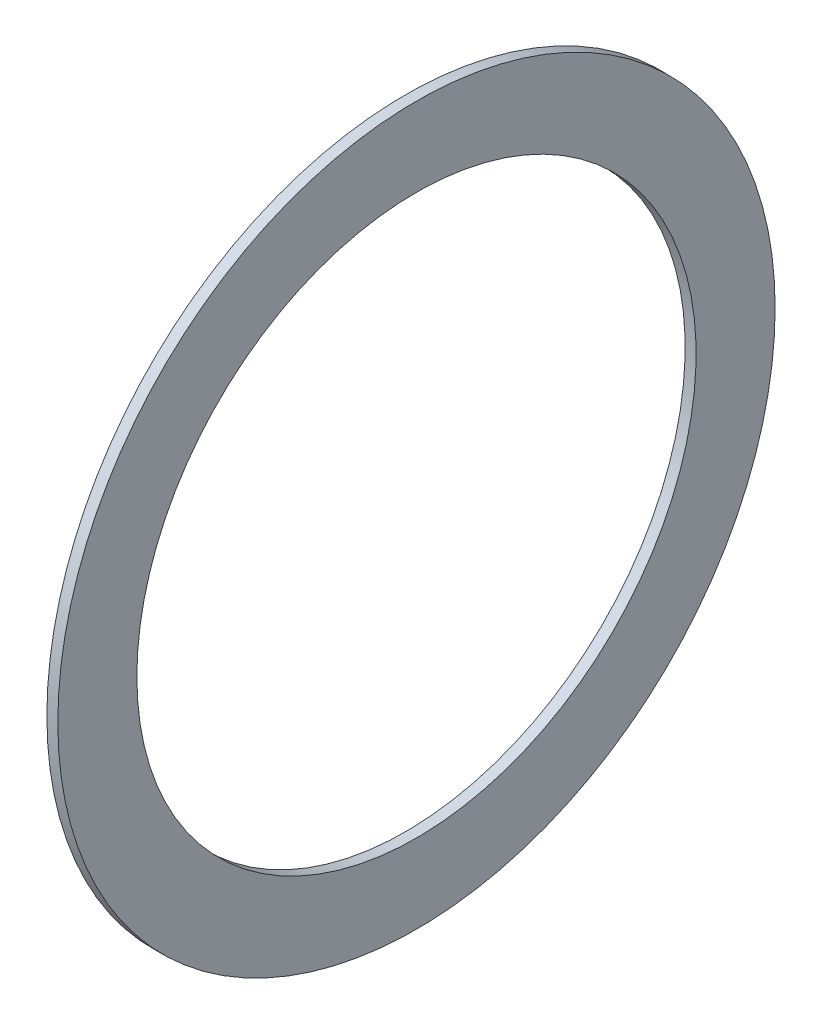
ISO-10303-21;
HEADER;
FILE_DESCRIPTION(('STEP AP214'),'2;1');
FILE_NAME('part.step','',(''),(''),'','','');
FILE_SCHEMA(('AUTOMOTIVE_DESIGN { 1 0 10303 214 1 1 1 1 }'));
ENDSEC;
DATA;
#1=APPLICATION_CONTEXT('core data for automotive mechanical design processes');
#2=APPLICATION_PROTOCOL_DEFINITION('international standard','automotive_design',2000,#1);
#3=PRODUCT_CONTEXT('',#1,'mechanical');
#4=PRODUCT('Part','Part','',(#3));
#5=PRODUCT_RELATED_PRODUCT_CATEGORY('part','',(#4));
#6=PRODUCT_DEFINITION_FORMATION('','',#4);
#7=PRODUCT_DEFINITION_CONTEXT('part definition',#1,'design');
#8=PRODUCT_DEFINITION('design','',#6,#7);
#9=PRODUCT_DEFINITION_SHAPE('','',#8);
#10=(LENGTH_UNIT() NAMED_UNIT(*) SI_UNIT(.MILLI.,.METRE.));
#11=(NAMED_UNIT(*) PLANE_ANGLE_UNIT() SI_UNIT($,.RADIAN.));
#12=(NAMED_UNIT(*) SI_UNIT($,.STERADIAN.) SOLID_ANGLE_UNIT());
#13=UNCERTAINTY_MEASURE_WITH_UNIT(LENGTH_MEASURE(1.E-05),#10,'distance_accuracy_value','');
#14=(GEOMETRIC_REPRESENTATION_CONTEXT(3) GLOBAL_UNCERTAINTY_ASSIGNED_CONTEXT((#13)) GLOBAL_UNIT_ASSIGNED_CONTEXT((#10,
#11,#12)) REPRESENTATION_CONTEXT('',''));
#15=CARTESIAN_POINT('',(0.,0.,0.));
#16=DIRECTION('',(0.,0.,1.));
#17=DIRECTION('',(1.,0.,0.));
#18=AXIS2_PLACEMENT_3D('',#15,#16,#17);
#19=CARTESIAN_POINT('',(7.68,52.5,49.05));
#20=DIRECTION('',(1.,0.,0.));
#21=DIRECTION('',(0.,1.,0.));
#22=AXIS2_PLACEMENT_3D('',#19,#20,#21);
#23=PLANE('',#22);
#24=CARTESIAN_POINT('',(7.68,52.5,33.3));
#25=DIRECTION('',(-1.,0.,0.));
#26=DIRECTION('',(0.,0.,1.));
#27=AXIS2_PLACEMENT_3D('',#24,#25,#26);
#28=CIRCLE('',#27,13.8);
#29=CARTESIAN_POINT('',(7.68,52.5,47.1));
#30=VERTEX_POINT('',#29);
#31=EDGE_CURVE('E9',#30,#30,#28,.T.);
#32=ORIENTED_EDGE('',*,*,#31,.T.);
#33=EDGE_LOOP('',(#32));
#34=FACE_BOUND('',#33,.T.);
#35=CARTESIAN_POINT('',(7.68,52.5,33.3));
#36=DIRECTION('',(-1.,0.,0.));
#37=DIRECTION('',(0.,0.,1.));
#38=AXIS2_PLACEMENT_3D('',#35,#36,#37);
#39=CIRCLE('',#38,17.7);
#40=CARTESIAN_POINT('',(7.68,52.5,51.));
#41=VERTEX_POINT('',#40);
#42=EDGE_CURVE('E31',#41,#41,#39,.T.);
#43=ORIENTED_EDGE('',*,*,#42,.F.);
#44=EDGE_LOOP('',(#43));
#45=FACE_BOUND('',#44,.T.);
#46=ADVANCED_FACE('F14',(#34,#45),#23,.T.);
#47=CARTESIAN_POINT('',(7.41,52.5,33.3));
#48=DIRECTION('',(1.,0.,0.));
#49=DIRECTION('',(0.,0.,1.));
#50=AXIS2_PLACEMENT_3D('',#47,#48,#49);
#51=CIRCLE('',#50,13.8);
#52=DIRECTION('',(-1.,0.,0.));
#53=VECTOR('',#52,1.);
#54=SURFACE_OF_LINEAR_EXTRUSION('',#51,#53);
#55=ORIENTED_EDGE('',*,*,#31,.F.);
#56=EDGE_LOOP('',(#55));
#57=FACE_BOUND('',#56,.T.);
#58=CARTESIAN_POINT('',(7.14,52.5,33.3));
#59=DIRECTION('',(-1.,0.,0.));
#60=DIRECTION('',(0.,0.,1.));
#61=AXIS2_PLACEMENT_3D('',#58,#59,#60);
#62=CIRCLE('',#61,13.8);
#63=CARTESIAN_POINT('',(7.14,52.5,47.1));
#64=VERTEX_POINT('',#63);
#65=EDGE_CURVE('E22',#64,#64,#62,.T.);
#66=ORIENTED_EDGE('',*,*,#65,.T.);
#67=EDGE_LOOP('',(#66));
#68=FACE_BOUND('',#67,.T.);
#69=ADVANCED_FACE('F38',(#57,#68),#54,.T.);
#70=CARTESIAN_POINT('',(7.14,52.5,49.05));
#71=DIRECTION('',(-1.,0.,0.));
#72=DIRECTION('',(0.,-1.,0.));
#73=AXIS2_PLACEMENT_3D('',#70,#71,#72);
#74=PLANE('',#73);
#75=CARTESIAN_POINT('',(7.14,52.5,33.3));
#76=DIRECTION('',(-1.,0.,0.));
#77=DIRECTION('',(0.,0.,1.));
#78=AXIS2_PLACEMENT_3D('',#75,#76,#77);
#79=CIRCLE('',#78,17.7);
#80=CARTESIAN_POINT('',(7.14,52.5,51.));
#81=VERTEX_POINT('',#80);
#82=EDGE_CURVE('E27',#81,#81,#79,.T.);
#83=ORIENTED_EDGE('',*,*,#82,.T.);
#84=EDGE_LOOP('',(#83));
#85=FACE_BOUND('',#84,.T.);
#86=ORIENTED_EDGE('',*,*,#65,.F.);
#87=EDGE_LOOP('',(#86));
#88=FACE_BOUND('',#87,.T.);
#89=ADVANCED_FACE('F44',(#85,#88),#74,.T.);
#90=CARTESIAN_POINT('',(7.41,52.5,33.3));
#91=DIRECTION('',(-1.,0.,0.));
#92=DIRECTION('',(0.,-1.,0.));
#93=AXIS2_PLACEMENT_3D('',#90,#91,#92);
#94=CYLINDRICAL_SURFACE('',#93,17.7);
#95=ORIENTED_EDGE('',*,*,#42,.T.);
#96=EDGE_LOOP('',(#95));
#97=FACE_BOUND('',#96,.T.);
#98=ORIENTED_EDGE('',*,*,#82,.F.);
#99=EDGE_LOOP('',(#98));
#100=FACE_BOUND('',#99,.T.);
#101=ADVANCED_FACE('F16',(#97,#100),#94,.T.);
#102=CLOSED_SHELL('',(#46,#69,#89,#101));
#103=MANIFOLD_SOLID_BREP('B1',#102);
#104=ADVANCED_BREP_SHAPE_REPRESENTATION('',(#18,#103),#14);
#105=SHAPE_DEFINITION_REPRESENTATION(#9,#104);
ENDSEC;
END-ISO-10303-21;
